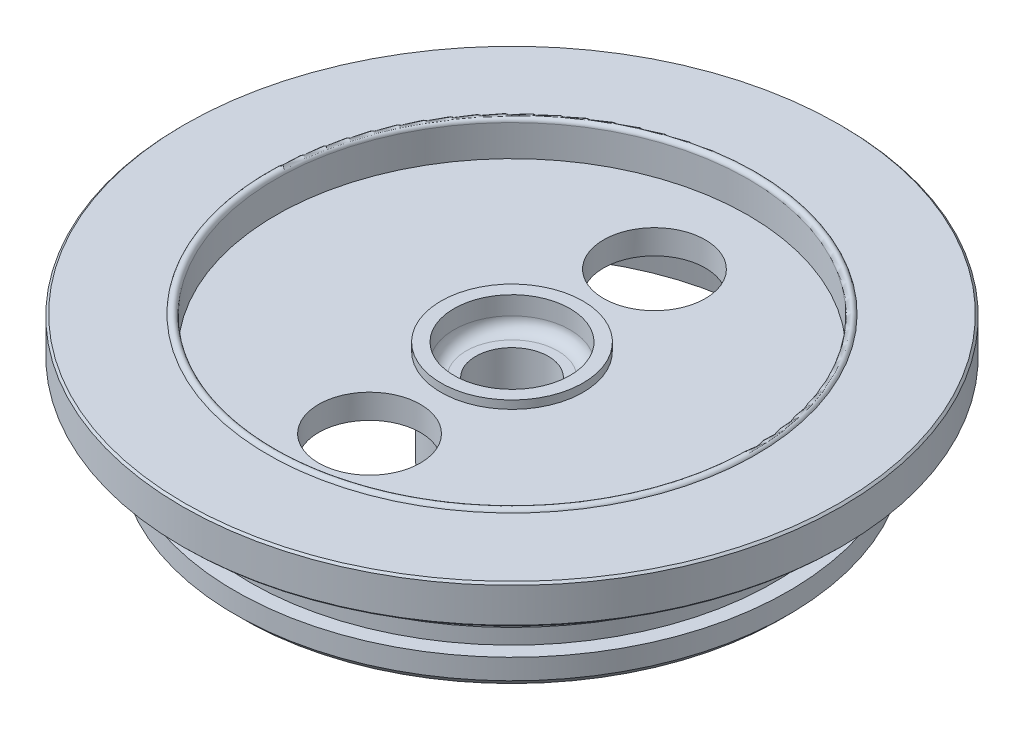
from build123d import *

# Parameters (mm, degrees)
ESQUISSE2_R             = 12.5
ENL_V_MAT_EXTRU_1_DEPTH = 10


with BuildPart() as part:
    # Esquisse1 → R_volution1 (revolve)
    with BuildSketch(Plane.XY, mode=Mode.PRIVATE) as r_volution1_sk:
        with BuildLine():
            Line((8.925, 5.361008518), (12.8, 5.361008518))
            Line((12.8, 5.361008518), (13.8, 6.361008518))
            Line((13.8, 6.361008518), (13.8, 34.498610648))
            Line((13.8, 34.498610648), (16.8, 34.498610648))
            Line((16.8, 34.498610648), (16.8, 51.361008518))
            Line((16.8, 51.361008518), (59.649080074, 51.361008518))
            Line((59.649080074, 51.361008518), (62.5, 33.361008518))
            Line((62.5, 33.361008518), (66, 33.361008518))
            Line((66, 33.361008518), (68, 35.361008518))
            Line((68, 35.361008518), (68, 40.361008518))
            Line((68, 40.361008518), (64.35, 40.361008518))
            Line((64.35, 40.361008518), (64.35, 46.711008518))
            Line((64.35, 46.711008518), (68, 46.711008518))
            Line((68, 46.711008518), (68, 55.861008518))
            Line((68, 55.861008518), (80.5, 55.861008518))
            Line((80.5, 55.861008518), (81, 56.361008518))
            Line((81, 56.361008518), (81, 64.861008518))
            Line((81, 64.861008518), (80.5, 65.361008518))
            Line((80.5, 65.361008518), (59.950879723, 65.361008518))
            ThreePointArc((59.950879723, 65.361008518), (58.841203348, 66.02710303), (58.003671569, 65.040389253))
            Line((58.003671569, 65.040389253), (58.003671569, 57.361008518))
            Line((58.003671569, 57.361008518), (17.45, 57.361008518))
            Line((17.45, 57.361008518), (17.45, 59.361008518))
            Line((17.45, 59.361008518), (14.25, 59.361008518))
            Line((14.25, 59.361008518), (14.25, 54.861008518))
            ThreePointArc((14.25, 54.861008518), (13.371320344, 52.739688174), (11.25, 51.861008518))
            Line((11.25, 51.861008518), (8.925, 51.861008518))
            Line((8.925, 51.861008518), (8.925, 5.361008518))
        make_face()
    revolve(r_volution1_sk.sketch.rotate(Axis((0, 0, 0), (0, 1, 0)), 90), axis=Axis((0, 0, 0), (0, 1, 0)))

    # Esquisse2 → Enl_v. mat.-Extru.1 (cut)
    with BuildSketch(Plane(origin=(0, 57.361008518, 0), x_dir=(1, 0, 0), z_dir=(0, 1, 0))):
        with Locations(Location((0, 35, 0), (0, 0, 270))):
            Circle(ESQUISSE2_R)
        with Locations(Location((0, -35, 0), (0, 0, 270))):
            Circle(ESQUISSE2_R)
    extrude(amount=-ENL_V_MAT_EXTRU_1_DEPTH, mode=Mode.SUBTRACT)


solid = part.part
